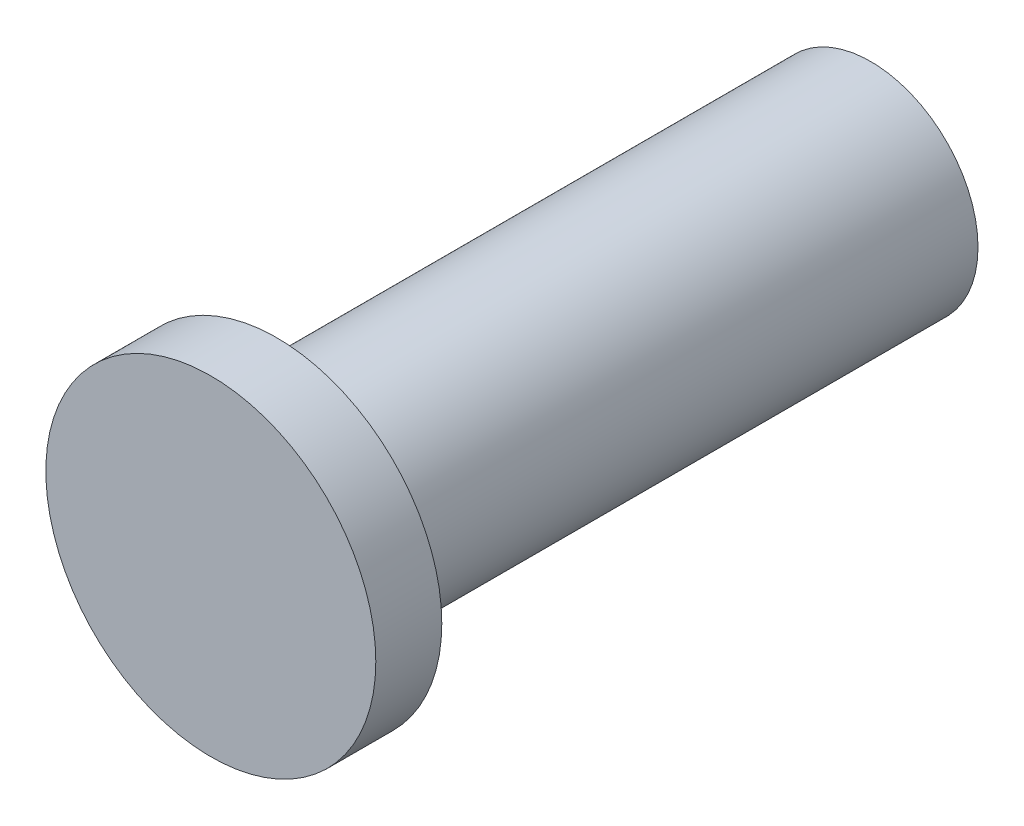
from build123d import *

# Parameters (mm, degrees)
SKETCH1_R           = 3.25
BOSS_EXTRUDE1_DEPTH = 20
SKETCH2_R           = 5
BOSS_EXTRUDE2_DEPTH = 2


with BuildPart() as part:
    # Sketch1 → Boss-Extrude1 (new body)
    with BuildSketch(Plane.XY):
        Circle(SKETCH1_R)
    extrude(amount=BOSS_EXTRUDE1_DEPTH)

    # Sketch2 → Boss-Extrude2 (add)
    with BuildSketch(Plane.XY.offset(20)):
        Circle(SKETCH2_R)
    extrude(amount=-BOSS_EXTRUDE2_DEPTH)


solid = part.part
